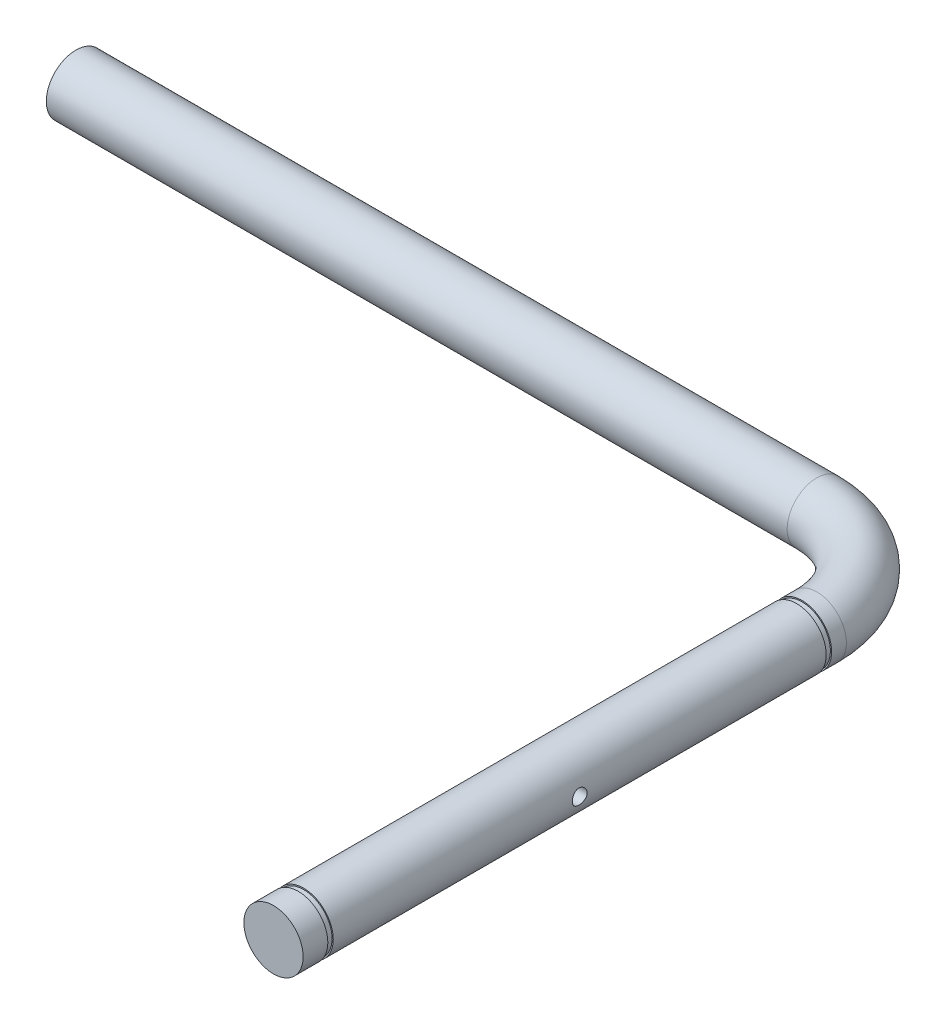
from build123d import *

# Parameters (mm, degrees)
SKIZZE1_R                            = 6
SKIZZE5_W                            = 1.1
SKIZZE5_H                            = 0.25
SCHNITT_LINEAR_AUSTRAGEN1_DEPTH      = 218.788888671
SCHNITT_LINEAR_AUSTRAGEN1_DEPTH_BACK = 218.788888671
SKIZZE6_R                            = 1.5


with BuildPart() as part:
    # Austragung1: sweep along a path in Skizze3
    with BuildLine(Plane(origin=(0, 0, 0), x_dir=(1, 0, 0), z_dir=(0, 1, 0))) as austragung1_path:
        Line((0, 0), (0, 110))
        ThreePointArc((0, 110), (-5.857864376, 124.142135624), (-20, 130))
        Line((-20, 130), (-170, 130))
    # Skizze1 → Austragung1 (sweep)
    with BuildSketch(Plane.XY):
        Circle(SKIZZE1_R)
    sweep(path=austragung1_path.line)

    # Skizze5 → Schnitt-Rotation1 (revolve, cut)
    with BuildSketch(Plane(origin=(0, 0, 0), x_dir=(0, 0, -1), z_dir=(1, 0, 0)), mode=Mode.PRIVATE) as schnitt_rotation1_sk:
        with Locations((5.55, 5.875)):
            Rectangle(SKIZZE5_W, SKIZZE5_H)
        with Locations((106.45, 5.875)):
            Rectangle(SKIZZE5_W, SKIZZE5_H)
    revolve(schnitt_rotation1_sk.sketch.rotate(Axis((0, 0, 0), (0, 0, -1)), 90), axis=Axis((0, 0, 0), (0, 0, -1)), mode=Mode.SUBTRACT)

    # Skizze6 → Schnitt-Linear austragen1 (cut, two sides: drawn at the far end of the back side and taken through both)
    with BuildSketch(Plane(origin=(0, 0, 0), x_dir=(0, 0, -1), z_dir=(1, 0, 0)).offset(-SCHNITT_LINEAR_AUSTRAGEN1_DEPTH_BACK)):
        with Locations((56, 0)):
            Circle(SKIZZE6_R)
    extrude(amount=SCHNITT_LINEAR_AUSTRAGEN1_DEPTH + SCHNITT_LINEAR_AUSTRAGEN1_DEPTH_BACK, mode=Mode.SUBTRACT)


solid = part.part
